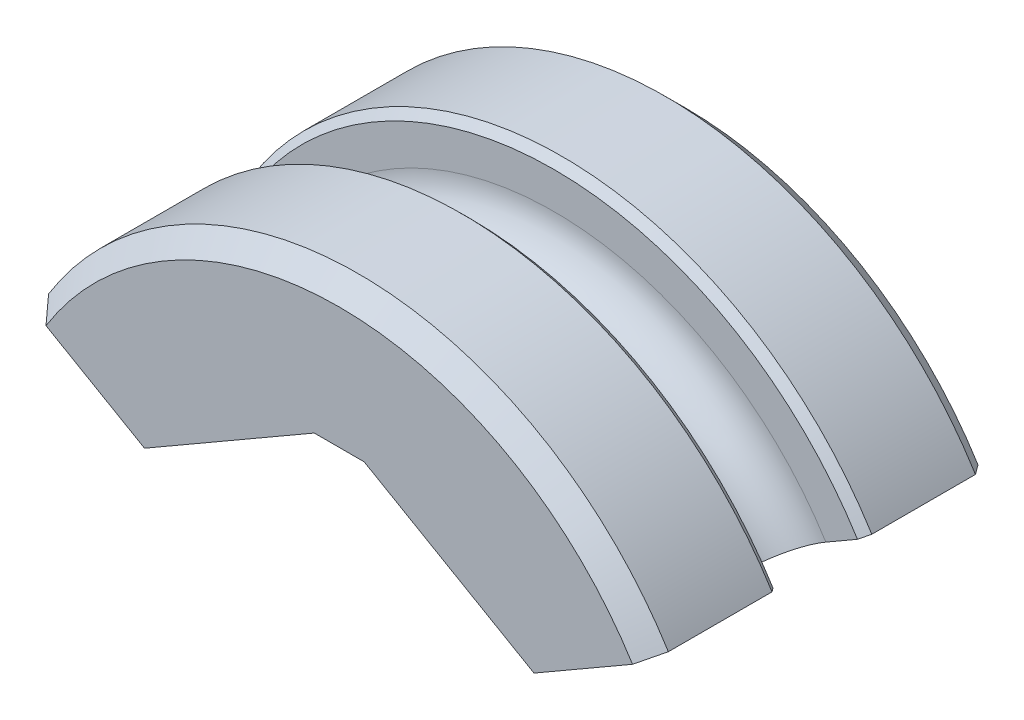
ISO-10303-21;
HEADER;
FILE_DESCRIPTION(('STEP AP214'),'2;1');
FILE_NAME('part.step','',(''),(''),'','','');
FILE_SCHEMA(('AUTOMOTIVE_DESIGN { 1 0 10303 214 1 1 1 1 }'));
ENDSEC;
DATA;
#1=APPLICATION_CONTEXT('core data for automotive mechanical design processes');
#2=APPLICATION_PROTOCOL_DEFINITION('international standard','automotive_design',2000,#1);
#3=PRODUCT_CONTEXT('',#1,'mechanical');
#4=PRODUCT('Part','Part','',(#3));
#5=PRODUCT_RELATED_PRODUCT_CATEGORY('part','',(#4));
#6=PRODUCT_DEFINITION_FORMATION('','',#4);
#7=PRODUCT_DEFINITION_CONTEXT('part definition',#1,'design');
#8=PRODUCT_DEFINITION('design','',#6,#7);
#9=PRODUCT_DEFINITION_SHAPE('','',#8);
#10=(LENGTH_UNIT() NAMED_UNIT(*) SI_UNIT(.MILLI.,.METRE.));
#11=(NAMED_UNIT(*) PLANE_ANGLE_UNIT() SI_UNIT($,.RADIAN.));
#12=(NAMED_UNIT(*) SI_UNIT($,.STERADIAN.) SOLID_ANGLE_UNIT());
#13=UNCERTAINTY_MEASURE_WITH_UNIT(LENGTH_MEASURE(1.E-05),#10,'distance_accuracy_value','');
#14=(GEOMETRIC_REPRESENTATION_CONTEXT(3) GLOBAL_UNCERTAINTY_ASSIGNED_CONTEXT((#13)) GLOBAL_UNIT_ASSIGNED_CONTEXT((#10,
#11,#12)) REPRESENTATION_CONTEXT('',''));
#15=CARTESIAN_POINT('',(0.,0.,0.));
#16=DIRECTION('',(0.,0.,1.));
#17=DIRECTION('',(1.,0.,0.));
#18=AXIS2_PLACEMENT_3D('',#15,#16,#17);
#19=CARTESIAN_POINT('',(0.,0.,16.4693044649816));
#20=DIRECTION('',(0.,0.,1.));
#21=DIRECTION('',(1.,0.,0.));
#22=AXIS2_PLACEMENT_3D('',#19,#20,#21);
#23=CYLINDRICAL_SURFACE('',#22,9.5);
#24=DIRECTION('',(0.,0.,1.));
#25=VECTOR('',#24,1.);
#26=CARTESIAN_POINT('',(-8.07313808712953,5.00743860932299,-9.99999999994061E-05));
#27=LINE('',#26,#25);
#28=CARTESIAN_POINT('',(-8.07313808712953,5.00743860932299,0.5));
#29=VERTEX_POINT('',#28);
#30=CARTESIAN_POINT('',(-8.07313808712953,5.00743860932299,3.2));
#31=VERTEX_POINT('',#30);
#32=EDGE_CURVE('E219',#29,#31,#27,.T.);
#33=ORIENTED_EDGE('',*,*,#32,.T.);
#34=CARTESIAN_POINT('',(0.,0.,3.2));
#35=DIRECTION('',(0.,0.,-1.));
#36=DIRECTION('',(-1.,0.,0.));
#37=AXIS2_PLACEMENT_3D('',#34,#35,#36);
#38=CIRCLE('',#37,9.5);
#39=CARTESIAN_POINT('',(8.07313808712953,5.00743860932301,3.2));
#40=VERTEX_POINT('',#39);
#41=EDGE_CURVE('E248',#31,#40,#38,.T.);
#42=ORIENTED_EDGE('',*,*,#41,.T.);
#43=DIRECTION('',(0.,0.,1.));
#44=VECTOR('',#43,1.);
#45=CARTESIAN_POINT('',(8.07313808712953,5.00743860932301,-9.99999999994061E-05));
#46=LINE('',#45,#44);
#47=CARTESIAN_POINT('',(8.07313808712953,5.00743860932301,0.5));
#48=VERTEX_POINT('',#47);
#49=EDGE_CURVE('E161',#48,#40,#46,.T.);
#50=ORIENTED_EDGE('',*,*,#49,.F.);
#51=CARTESIAN_POINT('',(0.,0.,0.5));
#52=DIRECTION('',(0.,0.,1.));
#53=DIRECTION('',(1.,0.,0.));
#54=AXIS2_PLACEMENT_3D('',#51,#52,#53);
#55=CIRCLE('',#54,9.5);
#56=EDGE_CURVE('E244',#48,#29,#55,.T.);
#57=ORIENTED_EDGE('',*,*,#56,.T.);
#58=EDGE_LOOP('',(#33,#42,#50,#57));
#59=FACE_BOUND('',#58,.T.);
#60=ADVANCED_FACE('F14',(#59),#23,.T.);
#61=CARTESIAN_POINT('',(0.,7.25555349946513,11.5));
#62=DIRECTION('',(0.469846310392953,0.813797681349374,-0.342020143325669));
#63=DIRECTION('',(0.866025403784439,-0.5,0.));
#64=AXIS2_PLACEMENT_3D('',#61,#62,#63);
#65=PLANE('',#64);
#66=DIRECTION('',(0.,0.387449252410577,0.921891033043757));
#67=VECTOR('',#66,1.);
#68=CARTESIAN_POINT('',(0.650000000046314,6.93661135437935,11.634043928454));
#69=LINE('',#68,#67);
#70=CARTESIAN_POINT('',(0.650000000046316,2.41402154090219,0.873060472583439));
#71=VERTEX_POINT('',#70);
#72=CARTESIAN_POINT('',(0.650000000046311,5.82958426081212,9.));
#73=VERTEX_POINT('',#72);
#74=EDGE_CURVE('E148',#71,#73,#69,.T.);
#75=ORIENTED_EDGE('',*,*,#74,.F.);
#76=CARTESIAN_POINT('',(0.,0.,-5.76375691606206));
#77=DIRECTION('',(0.469846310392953,0.813797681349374,-0.342020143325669));
#78=DIRECTION('',(-0.171010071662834,-0.296198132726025,-0.939692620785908));
#79=AXIS2_PLACEMENT_3D('',#76,#77,#78);
#80=ELLIPSE('',#79,7.30951100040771,2.5);
#81=CARTESIAN_POINT('',(1.99941852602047,1.50077498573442,0.553843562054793));
#82=VERTEX_POINT('',#81);
#83=EDGE_CURVE('E135',#71,#82,#80,.T.);
#84=ORIENTED_EDGE('',*,*,#83,.T.);
#85=DIRECTION('',(0.335540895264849,0.193724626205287,0.921891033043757));
#86=VECTOR('',#85,1.);
#87=CARTESIAN_POINT('',(5.53438182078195,3.5416869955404,10.2660753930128));
#88=LINE('',#87,#86);
#89=CARTESIAN_POINT('',(5.07356806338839,3.27563604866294,9.));
#90=VERTEX_POINT('',#89);
#91=EDGE_CURVE('E146',#82,#90,#88,.T.);
#92=ORIENTED_EDGE('',*,*,#91,.T.);
#93=DIRECTION('',(0.866025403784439,-0.5,0.));
#94=VECTOR('',#93,1.);
#95=CARTESIAN_POINT('',(2.68678403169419,4.65364645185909,9.));
#96=LINE('',#95,#94);
#97=EDGE_CURVE('E168',#73,#90,#96,.T.);
#98=ORIENTED_EDGE('',*,*,#97,.F.);
#99=EDGE_LOOP('',(#75,#84,#92,#98));
#100=FACE_BOUND('',#99,.T.);
#101=ADVANCED_FACE('F144',(#100),#65,.F.);
#102=CARTESIAN_POINT('',(-6.5,3.50277674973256,11.5));
#103=DIRECTION('',(-0.469846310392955,0.813797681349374,-0.342020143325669));
#104=DIRECTION('',(0.866025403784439,0.5,0.));
#105=AXIS2_PLACEMENT_3D('',#102,#103,#104);
#106=PLANE('',#105);
#107=DIRECTION('',(0.335540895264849,-0.193724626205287,-0.921891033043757));
#108=VECTOR('',#107,1.);
#109=CARTESIAN_POINT('',(-6.02226182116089,3.82336464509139,11.6065146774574));
#110=LINE('',#109,#108);
#111=CARTESIAN_POINT('',(-5.07356806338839,3.27563604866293,9.));
#112=VERTEX_POINT('',#111);
#113=CARTESIAN_POINT('',(-1.99941852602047,1.50077498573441,0.553843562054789));
#114=VERTEX_POINT('',#113);
#115=EDGE_CURVE('E156',#112,#114,#110,.T.);
#116=ORIENTED_EDGE('',*,*,#115,.T.);
#117=CARTESIAN_POINT('',(0.,0.,-5.76375691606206));
#118=DIRECTION('',(-0.469846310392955,0.813797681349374,-0.342020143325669));
#119=DIRECTION('',(0.171010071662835,-0.296198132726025,-0.939692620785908));
#120=AXIS2_PLACEMENT_3D('',#117,#118,#119);
#121=ELLIPSE('',#120,7.30951100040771,2.5);
#122=CARTESIAN_POINT('',(-0.650000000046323,2.41402154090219,0.873060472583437));
#123=VERTEX_POINT('',#122);
#124=EDGE_CURVE('E322',#114,#123,#121,.T.);
#125=ORIENTED_EDGE('',*,*,#124,.T.);
#126=DIRECTION('',(0.,-0.387449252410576,-0.921891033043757));
#127=VECTOR('',#126,1.);
#128=CARTESIAN_POINT('',(-0.650000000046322,6.37325605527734,10.2936046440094));
#129=LINE('',#128,#127);
#130=CARTESIAN_POINT('',(-0.65000000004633,5.82958426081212,9.));
#131=VERTEX_POINT('',#130);
#132=EDGE_CURVE('E170',#131,#123,#129,.T.);
#133=ORIENTED_EDGE('',*,*,#132,.F.);
#134=DIRECTION('',(0.866025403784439,0.5,0.));
#135=VECTOR('',#134,1.);
#136=CARTESIAN_POINT('',(-2.6867840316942,4.65364645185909,9.));
#137=LINE('',#136,#135);
#138=EDGE_CURVE('E166',#112,#131,#137,.T.);
#139=ORIENTED_EDGE('',*,*,#138,.F.);
#140=EDGE_LOOP('',(#116,#125,#133,#139));
#141=FACE_BOUND('',#140,.T.);
#142=ADVANCED_FACE('F331',(#141),#106,.F.);
#143=CARTESIAN_POINT('',(0.,0.,9.));
#144=DIRECTION('',(0.,0.,-1.));
#145=DIRECTION('',(-1.,0.,0.));
#146=AXIS2_PLACEMENT_3D('',#143,#144,#145);
#147=PLANE('',#146);
#148=DIRECTION('',(-0.866025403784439,-0.5,0.));
#149=VECTOR('',#148,1.);
#150=CARTESIAN_POINT('',(0.,0.346410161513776,9.));
#151=LINE('',#150,#149);
#152=CARTESIAN_POINT('',(7.63989730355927,4.75730692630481,9.));
#153=VERTEX_POINT('',#152);
#154=EDGE_CURVE('E153',#153,#90,#151,.T.);
#155=ORIENTED_EDGE('',*,*,#154,.F.);
#156=CARTESIAN_POINT('',(0.,0.,9.));
#157=DIRECTION('',(0.,0.,-1.));
#158=DIRECTION('',(-1.,0.,0.));
#159=AXIS2_PLACEMENT_3D('',#156,#157,#158);
#160=CIRCLE('',#159,9.);
#161=CARTESIAN_POINT('',(-7.63989730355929,4.75730692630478,9.));
#162=VERTEX_POINT('',#161);
#163=EDGE_CURVE('E249',#153,#162,#160,.F.);
#164=ORIENTED_EDGE('',*,*,#163,.T.);
#165=DIRECTION('',(-0.86602540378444,0.5,0.));
#166=VECTOR('',#165,1.);
#167=CARTESIAN_POINT('',(0.,0.346410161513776,9.));
#168=LINE('',#167,#166);
#169=EDGE_CURVE('E213',#112,#162,#168,.T.);
#170=ORIENTED_EDGE('',*,*,#169,.F.);
#171=ORIENTED_EDGE('',*,*,#138,.T.);
#172=DIRECTION('',(-1.,0.,0.));
#173=VECTOR('',#172,1.);
#174=CARTESIAN_POINT('',(1.5,5.82958426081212,9.));
#175=LINE('',#174,#173);
#176=EDGE_CURVE('E155',#73,#131,#175,.T.);
#177=ORIENTED_EDGE('',*,*,#176,.F.);
#178=ORIENTED_EDGE('',*,*,#97,.T.);
#179=EDGE_LOOP('',(#155,#164,#170,#171,#177,#178));
#180=FACE_BOUND('',#179,.T.);
#181=ADVANCED_FACE('F334',(#180),#147,.F.);
#182=CARTESIAN_POINT('',(8.07313808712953,5.00743860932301,5.8));
#183=VERTEX_POINT('',#182);
#184=CARTESIAN_POINT('',(8.07313808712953,5.00743860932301,8.5));
#185=VERTEX_POINT('',#184);
#186=EDGE_CURVE('E218',#183,#185,#46,.T.);
#187=ORIENTED_EDGE('',*,*,#186,.F.);
#188=CARTESIAN_POINT('',(0.,0.,5.8));
#189=DIRECTION('',(0.,0.,1.));
#190=DIRECTION('',(1.,0.,0.));
#191=AXIS2_PLACEMENT_3D('',#188,#189,#190);
#192=CIRCLE('',#191,9.5);
#193=CARTESIAN_POINT('',(-8.07313808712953,5.00743860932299,5.8));
#194=VERTEX_POINT('',#193);
#195=EDGE_CURVE('E140',#183,#194,#192,.T.);
#196=ORIENTED_EDGE('',*,*,#195,.T.);
#197=CARTESIAN_POINT('',(-8.07313808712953,5.00743860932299,8.5));
#198=VERTEX_POINT('',#197);
#199=EDGE_CURVE('E216',#194,#198,#27,.T.);
#200=ORIENTED_EDGE('',*,*,#199,.T.);
#201=CARTESIAN_POINT('',(0.,0.,8.5));
#202=DIRECTION('',(0.,0.,-1.));
#203=DIRECTION('',(-1.,0.,0.));
#204=AXIS2_PLACEMENT_3D('',#201,#202,#203);
#205=CIRCLE('',#204,9.5);
#206=EDGE_CURVE('E233',#198,#185,#205,.T.);
#207=ORIENTED_EDGE('',*,*,#206,.T.);
#208=EDGE_LOOP('',(#187,#196,#200,#207));
#209=FACE_BOUND('',#208,.T.);
#210=ADVANCED_FACE('F231',(#209),#23,.T.);
#211=CARTESIAN_POINT('',(0.,0.,0.));
#212=DIRECTION('',(0.,0.,1.));
#213=DIRECTION('',(1.,0.,0.));
#214=AXIS2_PLACEMENT_3D('',#211,#212,#213);
#215=PLANE('',#214);
#216=DIRECTION('',(-0.866025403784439,-0.5,0.));
#217=VECTOR('',#216,1.);
#218=CARTESIAN_POINT('',(-0.15,0.259807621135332,0.));
#219=LINE('',#218,#217);
#220=CARTESIAN_POINT('',(7.63989730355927,4.75730692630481,0.));
#221=VERTEX_POINT('',#220);
#222=CARTESIAN_POINT('',(2.17379000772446,1.60144840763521,0.));
#223=VERTEX_POINT('',#222);
#224=EDGE_CURVE('E175',#221,#223,#219,.T.);
#225=ORIENTED_EDGE('',*,*,#224,.T.);
#226=CARTESIAN_POINT('',(0.,0.,0.));
#227=DIRECTION('',(0.,0.,1.));
#228=DIRECTION('',(1.,0.,0.));
#229=AXIS2_PLACEMENT_3D('',#226,#227,#228);
#230=CIRCLE('',#229,2.7);
#231=CARTESIAN_POINT('',(-2.17379000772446,1.6014484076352,0.));
#232=VERTEX_POINT('',#231);
#233=EDGE_CURVE('E28',#223,#232,#230,.T.);
#234=ORIENTED_EDGE('',*,*,#233,.T.);
#235=DIRECTION('',(-0.86602540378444,0.5,0.));
#236=VECTOR('',#235,1.);
#237=CARTESIAN_POINT('',(0.15,0.259807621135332,0.));
#238=LINE('',#237,#236);
#239=CARTESIAN_POINT('',(-7.63989730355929,4.75730692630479,0.));
#240=VERTEX_POINT('',#239);
#241=EDGE_CURVE('E173',#232,#240,#238,.T.);
#242=ORIENTED_EDGE('',*,*,#241,.T.);
#243=CARTESIAN_POINT('',(0.,0.,0.));
#244=DIRECTION('',(0.,0.,1.));
#245=DIRECTION('',(1.,0.,0.));
#246=AXIS2_PLACEMENT_3D('',#243,#244,#245);
#247=CIRCLE('',#246,9.);
#248=EDGE_CURVE('E482',#240,#221,#247,.F.);
#249=ORIENTED_EDGE('',*,*,#248,.T.);
#250=EDGE_LOOP('',(#225,#234,#242,#249));
#251=FACE_BOUND('',#250,.T.);
#252=ADVANCED_FACE('F343',(#251),#215,.F.);
#253=CARTESIAN_POINT('',(1.5,5.82958426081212,9.));
#254=DIRECTION('',(0.,0.921891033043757,-0.387449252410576));
#255=DIRECTION('',(0.,0.387449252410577,0.921891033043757));
#256=AXIS2_PLACEMENT_3D('',#253,#254,#255);
#257=PLANE('',#256);
#258=ORIENTED_EDGE('',*,*,#132,.T.);
#259=CARTESIAN_POINT('',(0.,0.,-4.87082675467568));
#260=DIRECTION('',(0.,0.921891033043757,-0.387449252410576));
#261=DIRECTION('',(0.,-0.387449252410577,-0.921891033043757));
#262=AXIS2_PLACEMENT_3D('',#259,#260,#261);
#263=ELLIPSE('',#262,6.45245792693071,2.5);
#264=EDGE_CURVE('E149',#123,#71,#263,.T.);
#265=ORIENTED_EDGE('',*,*,#264,.T.);
#266=ORIENTED_EDGE('',*,*,#74,.T.);
#267=ORIENTED_EDGE('',*,*,#176,.T.);
#268=EDGE_LOOP('',(#258,#265,#266,#267));
#269=FACE_BOUND('',#268,.T.);
#270=ADVANCED_FACE('F326',(#269),#257,.F.);
#271=CARTESIAN_POINT('',(0.,0.346410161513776,-9.99999999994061E-05));
#272=DIRECTION('',(0.5,0.86602540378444,0.));
#273=DIRECTION('',(-0.86602540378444,0.5,0.));
#274=AXIS2_PLACEMENT_3D('',#271,#272,#273);
#275=PLANE('',#274);
#276=ORIENTED_EDGE('',*,*,#241,.F.);
#277=CARTESIAN_POINT('',(-2.17379000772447,1.6014484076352,0.));
#278=CARTESIAN_POINT('',(-2.14473559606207,1.58467383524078,0.0333420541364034));
#279=CARTESIAN_POINT('',(-2.11567743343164,1.56789709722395,0.0666797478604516));
#280=CARTESIAN_POINT('',(-2.05755360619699,1.53433928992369,0.13334641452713));
#281=CARTESIAN_POINT('',(-2.02848794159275,1.51755822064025,0.166675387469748));
#282=CARTESIAN_POINT('',(-1.99941852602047,1.50077498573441,0.2));
#283=B_SPLINE_CURVE_WITH_KNOTS('',3,(#277,#278,#279,#280,#281,#282),.UNSPECIFIED.,.F.,.F.,(4,2,
4),(0.,0.141898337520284,0.28379667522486),.UNSPECIFIED.);
#284=CARTESIAN_POINT('',(-1.99941852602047,1.50077498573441,0.2));
#285=VERTEX_POINT('',#284);
#286=EDGE_CURVE('E9',#232,#285,#283,.T.);
#287=ORIENTED_EDGE('',*,*,#286,.T.);
#288=DIRECTION('',(0.,0.,-1.));
#289=VECTOR('',#288,1.);
#290=CARTESIAN_POINT('',(-1.99941852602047,1.50077498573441,9.));
#291=LINE('',#290,#289);
#292=EDGE_CURVE('E318',#285,#114,#291,.F.);
#293=ORIENTED_EDGE('',*,*,#292,.T.);
#294=ORIENTED_EDGE('',*,*,#115,.F.);
#295=ORIENTED_EDGE('',*,*,#169,.T.);
#296=CARTESIAN_POINT('',(-7.63989730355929,4.75730692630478,9.));
#297=CARTESIAN_POINT('',(-7.71210512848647,4.79899613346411,8.91666785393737));
#298=CARTESIAN_POINT('',(-7.78431243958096,4.84068504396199,8.83333511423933));
#299=CARTESIAN_POINT('',(-7.92872603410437,4.92406227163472,8.66666844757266));
#300=CARTESIAN_POINT('',(-8.00093231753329,4.96575058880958,8.58333452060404));
#301=CARTESIAN_POINT('',(-8.07313808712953,5.00743860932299,8.5));
#302=B_SPLINE_CURVE_WITH_KNOTS('',3,(#296,#297,#298,#299,#300,#301),.UNSPECIFIED.,.F.,.F.,(4,2,
4),(0.,0.353646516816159,0.707293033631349),.UNSPECIFIED.);
#303=EDGE_CURVE('E238',#162,#198,#302,.T.);
#304=ORIENTED_EDGE('',*,*,#303,.T.);
#305=ORIENTED_EDGE('',*,*,#199,.F.);
#306=CARTESIAN_POINT('',(-8.07313808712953,5.00743860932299,5.8));
#307=CARTESIAN_POINT('',(-8.04425601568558,4.9907635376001,5.76666648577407));
#308=CARTESIAN_POINT('',(-8.01537386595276,4.97408842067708,5.73333306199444));
#309=CARTESIAN_POINT('',(-7.95760940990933,4.94073809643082,5.66666639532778));
#310=CARTESIAN_POINT('',(-7.92872710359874,4.92406288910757,5.63333315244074));
#311=CARTESIAN_POINT('',(-7.89984471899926,4.9073876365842,5.6));
#312=B_SPLINE_CURVE_WITH_KNOTS('',3,(#306,#307,#308,#309,#310,#311),.UNSPECIFIED.,.F.,.F.,(4,2,
4),(0.,0.141457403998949,0.28291480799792),.UNSPECIFIED.);
#313=CARTESIAN_POINT('',(-7.89984471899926,4.9073876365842,5.6));
#314=VERTEX_POINT('',#313);
#315=EDGE_CURVE('E278',#194,#314,#312,.T.);
#316=ORIENTED_EDGE('',*,*,#315,.T.);
#317=DIRECTION('',(0.86602540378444,-0.5,0.));
#318=VECTOR('',#317,1.);
#319=CARTESIAN_POINT('',(0.,0.346410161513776,5.6));
#320=LINE('',#319,#318);
#321=CARTESIAN_POINT('',(-7.07664341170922,4.43211214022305,5.6));
#322=VERTEX_POINT('',#321);
#323=EDGE_CURVE('E306',#314,#322,#320,.T.);
#324=ORIENTED_EDGE('',*,*,#323,.T.);
#325=CARTESIAN_POINT('',(-6.40427982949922,4.0439228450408,3.72019614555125));
#326=CARTESIAN_POINT('',(-6.44226630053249,4.06585434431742,3.67659501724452));
#327=CARTESIAN_POINT('',(-6.48347090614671,4.08964383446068,3.63666795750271));
#328=CARTESIAN_POINT('',(-6.5711361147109,4.14025736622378,3.5653372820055));
#329=CARTESIAN_POINT('',(-6.6176030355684,4.16708505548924,3.53394406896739));
#330=CARTESIAN_POINT('',(-6.71442280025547,4.22298397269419,3.48062452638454));
#331=CARTESIAN_POINT('',(-6.76477369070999,4.25205407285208,3.45869347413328));
#332=CARTESIAN_POINT('',(-6.86793499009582,4.31161427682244,3.42490666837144));
#333=CARTESIAN_POINT('',(-6.92074478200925,4.34210402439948,3.41304840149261));
#334=CARTESIAN_POINT('',(-7.02736153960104,4.40365923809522,3.39972928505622));
#335=CARTESIAN_POINT('',(-7.08116891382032,4.43472494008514,3.3982727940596));
#336=CARTESIAN_POINT('',(-7.18823385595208,4.49653891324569,3.40581149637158));
#337=CARTESIAN_POINT('',(-7.24149140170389,4.52728717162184,3.41480710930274));
#338=CARTESIAN_POINT('',(-7.34594081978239,4.58759107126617,3.4429965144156));
#339=CARTESIAN_POINT('',(-7.3971327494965,4.61714674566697,3.46219002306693));
#340=CARTESIAN_POINT('',(-7.49599769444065,4.67422644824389,3.51023223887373));
#341=CARTESIAN_POINT('',(-7.54367072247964,4.70175048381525,3.53908091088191));
#342=CARTESIAN_POINT('',(-7.63412506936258,4.75397432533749,3.60560359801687));
#343=CARTESIAN_POINT('',(-7.67690822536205,4.7786751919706,3.64327428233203));
#344=CARTESIAN_POINT('',(-7.75638638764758,4.82456193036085,3.72637887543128));
#345=CARTESIAN_POINT('',(-7.79308142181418,4.84574781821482,3.77181274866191));
#346=CARTESIAN_POINT('',(-7.85932064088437,4.88399104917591,3.86912770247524));
#347=CARTESIAN_POINT('',(-7.888868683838,4.90105061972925,3.9210052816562));
#348=CARTESIAN_POINT('',(-7.93999841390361,4.93057038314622,4.02975450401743));
#349=CARTESIAN_POINT('',(-7.96158011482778,4.94303058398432,4.08662613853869));
#350=CARTESIAN_POINT('',(-7.99615381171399,4.96299171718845,4.20371885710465));
#351=CARTESIAN_POINT('',(-8.00915003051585,4.9704950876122,4.26393827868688));
#352=CARTESIAN_POINT('',(-8.02619969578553,4.98033871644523,4.38604200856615));
#353=CARTESIAN_POINT('',(-8.03025316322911,4.98267898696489,4.44792631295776));
#354=CARTESIAN_POINT('',(-8.02930206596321,4.9821298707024,4.57158420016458));
#355=CARTESIAN_POINT('',(-8.02430010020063,4.97924198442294,4.63335780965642));
#356=CARTESIAN_POINT('',(-8.00538560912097,4.96832169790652,4.75505849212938));
#357=CARTESIAN_POINT('',(-7.99147308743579,4.96028929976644,4.81498556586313));
#358=CARTESIAN_POINT('',(-7.95513346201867,4.93930860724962,4.93129226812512));
#359=CARTESIAN_POINT('',(-7.9327063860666,4.92636032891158,4.98767190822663));
#360=CARTESIAN_POINT('',(-7.87997554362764,4.89591616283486,5.09528494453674));
#361=CARTESIAN_POINT('',(-7.84967176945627,4.87842027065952,5.1465183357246));
#362=CARTESIAN_POINT('',(-7.78203927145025,4.83937262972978,5.24240053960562));
#363=CARTESIAN_POINT('',(-7.74470857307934,4.81781974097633,5.28704749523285));
#364=CARTESIAN_POINT('',(-7.6640884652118,4.77127369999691,5.36847514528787));
#365=CARTESIAN_POINT('',(-7.62079904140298,4.74628053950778,5.40525582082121));
#366=CARTESIAN_POINT('',(-7.52946788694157,4.6935504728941,5.46992631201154));
#367=CARTESIAN_POINT('',(-7.48142384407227,4.66581223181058,5.4978117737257));
#368=CARTESIAN_POINT('',(-7.38196487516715,4.60838956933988,5.54387894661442));
#369=CARTESIAN_POINT('',(-7.33054993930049,4.57870514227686,5.56206062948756));
#370=CARTESIAN_POINT('',(-7.2257788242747,4.51821551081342,5.58821414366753));
#371=CARTESIAN_POINT('',(-7.17242160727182,4.48740970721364,5.59618043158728));
#372=CARTESIAN_POINT('',(-7.06530605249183,4.42556651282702,5.60166059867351));
#373=CARTESIAN_POINT('',(-7.0115477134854,4.39452912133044,5.59917444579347));
#374=CARTESIAN_POINT('',(-6.90513401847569,4.33309114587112,5.58381784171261));
#375=CARTESIAN_POINT('',(-6.85247909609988,4.30269081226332,5.57094338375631));
#376=CARTESIAN_POINT('',(-6.74978832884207,4.24340227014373,5.53516995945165));
#377=CARTESIAN_POINT('',(-6.69975248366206,4.21451406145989,5.51227099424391));
#378=CARTESIAN_POINT('',(-6.60371996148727,4.15906965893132,5.45709638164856));
#379=CARTESIAN_POINT('',(-6.55772336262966,4.1325135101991,5.42482055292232));
#380=CARTESIAN_POINT('',(-6.47107824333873,4.08248892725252,5.3518064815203));
#381=CARTESIAN_POINT('',(-6.4304297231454,4.05902049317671,5.31106823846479));
#382=CARTESIAN_POINT('',(-6.35565491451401,4.01584923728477,5.22230398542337));
#383=CARTESIAN_POINT('',(-6.32152575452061,3.9961447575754,5.17428120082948));
#384=CARTESIAN_POINT('',(-6.26074023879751,3.96105022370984,5.07229673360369));
#385=CARTESIAN_POINT('',(-6.23408386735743,3.94566016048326,5.01833506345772));
#386=CARTESIAN_POINT('',(-6.18902179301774,3.91964355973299,4.9060472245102));
#387=CARTESIAN_POINT('',(-6.17061002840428,3.90901352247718,4.84772429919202));
#388=CARTESIAN_POINT('',(-6.14253497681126,3.89280438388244,4.72833785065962));
#389=CARTESIAN_POINT('',(-6.13287130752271,3.88722506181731,4.66727444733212));
#390=CARTESIAN_POINT('',(-6.12257118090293,3.8812782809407,4.54419000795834));
#391=CARTESIAN_POINT('',(-6.12192759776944,3.88090670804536,4.48216976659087));
#392=CARTESIAN_POINT('',(-6.12966978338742,3.88537666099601,4.35886842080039));
#393=CARTESIAN_POINT('',(-6.13805778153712,3.89021947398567,4.29758750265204));
#394=CARTESIAN_POINT('',(-6.16362614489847,3.90498137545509,4.17751060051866));
#395=CARTESIAN_POINT('',(-6.180808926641,3.9149018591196,4.11871530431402));
#396=CARTESIAN_POINT('',(-6.22346838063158,3.93953130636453,4.00534160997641));
#397=CARTESIAN_POINT('',(-6.24893505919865,3.95423450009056,3.9507582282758));
#398=CARTESIAN_POINT('',(-6.29639416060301,3.98163502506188,3.86679941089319));
#399=CARTESIAN_POINT('',(-6.31609280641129,3.99300804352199,3.83566228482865));
#400=CARTESIAN_POINT('',(-6.35820468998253,4.01732135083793,3.77594029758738));
#401=CARTESIAN_POINT('',(-6.38061792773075,4.03026163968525,3.74735543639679));
#402=CARTESIAN_POINT('',(-6.40427982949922,4.0439228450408,3.72019614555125));
#403=B_SPLINE_CURVE_WITH_KNOTS('',3,(#325,#326,#327,#328,#329,#330,#331,#332,#333,#334,#335,
#336,#337,#338,#339,#340,#341,#342,#343,#344,#345,#346,#347,#348,#349,#350,#351,#352,#353,#354,
#355,#356,#357,#358,#359,#360,#361,#362,#363,#364,#365,#366,#367,#368,#369,#370,#371,#372,#373,
#374,#375,#376,#377,#378,#379,#380,#381,#382,#383,#384,#385,#386,#387,#388,#389,#390,#391,#392,
#393,#394,#395,#396,#397,#398,#399,#400,#401,#402),.UNSPECIFIED.,.T.,.F.,(4,2,2,2,2,2,2,2,2,2,2,
2,2,2,2,2,2,2,2,2,2,2,2,2,2,2,2,2,2,2,2,2,2,2,2,2,2,2,4),(0.,0.185399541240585,
0.371024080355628,0.556555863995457,0.742041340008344,0.927604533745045,1.11317517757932,
1.29874066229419,1.48430547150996,1.66980033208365,1.85529434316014,2.04068799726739,
2.22608132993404,2.41138340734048,2.59668505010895,2.78193351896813,2.96718191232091,
3.15242970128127,3.33767767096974,3.52297777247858,3.7082783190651,3.89366942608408,
4.07906107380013,4.26455328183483,4.45004605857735,4.63561041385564,4.82117474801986,
5.00674267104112,5.19231060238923,5.37779660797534,5.56328222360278,5.74863123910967,
5.93397215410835,6.11916664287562,6.30440685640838,6.48969799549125,6.67476642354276,
6.79025242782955,6.90573843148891),.UNSPECIFIED.);
#404=CARTESIAN_POINT('',(-7.07664341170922,4.43211214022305,3.4));
#405=VERTEX_POINT('',#404);
#406=EDGE_CURVE('E203',#322,#405,#403,.T.);
#407=ORIENTED_EDGE('',*,*,#406,.T.);
#408=DIRECTION('',(-0.86602540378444,0.5,0.));
#409=VECTOR('',#408,1.);
#410=CARTESIAN_POINT('',(0.,0.346410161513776,3.4));
#411=LINE('',#410,#409);
#412=CARTESIAN_POINT('',(-7.89984471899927,4.9073876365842,3.4));
#413=VERTEX_POINT('',#412);
#414=EDGE_CURVE('E210',#405,#413,#411,.T.);
#415=ORIENTED_EDGE('',*,*,#414,.T.);
#416=CARTESIAN_POINT('',(-7.89984471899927,4.9073876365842,3.4));
#417=CARTESIAN_POINT('',(-7.92872710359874,4.92406288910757,3.36666684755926));
#418=CARTESIAN_POINT('',(-7.95760940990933,4.94073809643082,3.33333360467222));
#419=CARTESIAN_POINT('',(-8.01537386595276,4.97408842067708,3.26666693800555));
#420=CARTESIAN_POINT('',(-8.04425601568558,4.9907635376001,3.23333351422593));
#421=CARTESIAN_POINT('',(-8.07313808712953,5.00743860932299,3.2));
#422=B_SPLINE_CURVE_WITH_KNOTS('',3,(#416,#417,#418,#419,#420,#421),.UNSPECIFIED.,.F.,.F.,(4,2,
4),(0.,0.141457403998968,0.282914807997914),.UNSPECIFIED.);
#423=EDGE_CURVE('E284',#413,#31,#422,.T.);
#424=ORIENTED_EDGE('',*,*,#423,.T.);
#425=ORIENTED_EDGE('',*,*,#32,.F.);
#426=CARTESIAN_POINT('',(-8.07313808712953,5.00743860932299,0.5));
#427=CARTESIAN_POINT('',(-8.0009323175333,4.96575058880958,0.416665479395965));
#428=CARTESIAN_POINT('',(-7.92872603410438,4.92406227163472,0.333331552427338));
#429=CARTESIAN_POINT('',(-7.78431243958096,4.84068504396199,0.166664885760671));
#430=CARTESIAN_POINT('',(-7.71210512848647,4.79899613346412,0.0833321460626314));
#431=CARTESIAN_POINT('',(-7.63989730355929,4.75730692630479,0.));
#432=B_SPLINE_CURVE_WITH_KNOTS('',3,(#426,#427,#428,#429,#430,#431),.UNSPECIFIED.,.F.,.F.,(4,2,
4),(0.,0.353646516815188,0.707293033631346),.UNSPECIFIED.);
#433=EDGE_CURVE('E243',#29,#240,#432,.T.);
#434=ORIENTED_EDGE('',*,*,#433,.T.);
#435=EDGE_LOOP('',(#276,#287,#293,#294,#295,#304,#305,#316,#324,#407,#415,#424,#425,#434));
#436=FACE_BOUND('',#435,.T.);
#437=ADVANCED_FACE('F199',(#436),#275,.F.);
#438=CARTESIAN_POINT('',(0.,0.346410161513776,-9.99999999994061E-05));
#439=DIRECTION('',(-0.5,0.866025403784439,0.));
#440=DIRECTION('',(-0.866025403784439,-0.5,0.));
#441=AXIS2_PLACEMENT_3D('',#438,#439,#440);
#442=PLANE('',#441);
#443=DIRECTION('',(0.,0.,-1.));
#444=VECTOR('',#443,1.);
#445=CARTESIAN_POINT('',(1.99941852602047,1.50077498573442,9.));
#446=LINE('',#445,#444);
#447=CARTESIAN_POINT('',(1.99941852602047,1.50077498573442,0.2));
#448=VERTEX_POINT('',#447);
#449=EDGE_CURVE('E131',#82,#448,#446,.T.);
#450=ORIENTED_EDGE('',*,*,#449,.T.);
#451=CARTESIAN_POINT('',(1.99941852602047,1.50077498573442,0.2));
#452=CARTESIAN_POINT('',(2.02848794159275,1.51755822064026,0.166675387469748));
#453=CARTESIAN_POINT('',(2.05755360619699,1.53433928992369,0.133346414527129));
#454=CARTESIAN_POINT('',(2.11567743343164,1.56789709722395,0.0666797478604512));
#455=CARTESIAN_POINT('',(2.14473559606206,1.58467383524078,0.0333420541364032));
#456=CARTESIAN_POINT('',(2.17379000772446,1.60144840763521,0.));
#457=B_SPLINE_CURVE_WITH_KNOTS('',3,(#451,#452,#453,#454,#455,#456),.UNSPECIFIED.,.F.,.F.,(4,2,
4),(0.,0.141898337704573,0.283796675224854),.UNSPECIFIED.);
#458=EDGE_CURVE('E42',#448,#223,#457,.T.);
#459=ORIENTED_EDGE('',*,*,#458,.T.);
#460=ORIENTED_EDGE('',*,*,#224,.F.);
#461=CARTESIAN_POINT('',(7.63989730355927,4.75730692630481,0.));
#462=CARTESIAN_POINT('',(7.71210512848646,4.79899613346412,0.0833321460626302));
#463=CARTESIAN_POINT('',(7.78431243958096,4.84068504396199,0.166664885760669));
#464=CARTESIAN_POINT('',(7.92872603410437,4.92406227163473,0.333331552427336));
#465=CARTESIAN_POINT('',(8.00093231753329,4.96575058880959,0.416665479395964));
#466=CARTESIAN_POINT('',(8.07313808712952,5.00743860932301,0.5));
#467=B_SPLINE_CURVE_WITH_KNOTS('',3,(#461,#462,#463,#464,#465,#466),.UNSPECIFIED.,.F.,.F.,(4,2,
4),(0.,0.353646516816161,0.707293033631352),.UNSPECIFIED.);
#468=EDGE_CURVE('E253',#221,#48,#467,.T.);
#469=ORIENTED_EDGE('',*,*,#468,.T.);
#470=ORIENTED_EDGE('',*,*,#49,.T.);
#471=CARTESIAN_POINT('',(8.07313808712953,5.00743860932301,3.2));
#472=CARTESIAN_POINT('',(8.04425601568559,4.9907635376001,3.23333351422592));
#473=CARTESIAN_POINT('',(8.01537386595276,4.97408842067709,3.26666693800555));
#474=CARTESIAN_POINT('',(7.95760940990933,4.94073809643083,3.33333360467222));
#475=CARTESIAN_POINT('',(7.92872710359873,4.92406288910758,3.36666684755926));
#476=CARTESIAN_POINT('',(7.89984471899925,4.90738763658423,3.4));
#477=B_SPLINE_CURVE_WITH_KNOTS('',3,(#471,#472,#473,#474,#475,#476),.UNSPECIFIED.,.F.,.F.,(4,2,
4),(0.,0.14145740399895,0.282914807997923),.UNSPECIFIED.);
#478=CARTESIAN_POINT('',(7.89984471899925,4.90738763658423,3.4));
#479=VERTEX_POINT('',#478);
#480=EDGE_CURVE('E262',#40,#479,#477,.T.);
#481=ORIENTED_EDGE('',*,*,#480,.T.);
#482=DIRECTION('',(-0.866025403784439,-0.5,0.));
#483=VECTOR('',#482,1.);
#484=CARTESIAN_POINT('',(0.,0.346410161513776,3.4));
#485=LINE('',#484,#483);
#486=CARTESIAN_POINT('',(7.07664341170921,4.43211214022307,3.4));
#487=VERTEX_POINT('',#486);
#488=EDGE_CURVE('E188',#479,#487,#485,.T.);
#489=ORIENTED_EDGE('',*,*,#488,.T.);
#490=CARTESIAN_POINT('',(6.20692615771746,3.92998064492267,4.04951629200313));
#491=CARTESIAN_POINT('',(6.18501497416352,3.91733021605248,4.10583774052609));
#492=CARTESIAN_POINT('',(6.16720559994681,3.90704797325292,4.16433601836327));
#493=CARTESIAN_POINT('',(6.14033110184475,3.89153197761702,4.28400355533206));
#494=CARTESIAN_POINT('',(6.13127646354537,3.88630427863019,4.34517592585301));
#495=CARTESIAN_POINT('',(6.12219634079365,3.88106186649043,4.46838488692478));
#496=CARTESIAN_POINT('',(6.12216666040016,3.8810447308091,4.53042106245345));
#497=CARTESIAN_POINT('',(6.13112914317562,3.88621922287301,4.65360133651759));
#498=CARTESIAN_POINT('',(6.14011907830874,3.89140956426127,4.71474565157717));
#499=CARTESIAN_POINT('',(6.16685974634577,3.90684829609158,4.83442398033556));
#500=CARTESIAN_POINT('',(6.18461040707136,3.91709664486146,4.89295801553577));
#501=CARTESIAN_POINT('',(6.22836742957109,3.94235977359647,5.00575848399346));
#502=CARTESIAN_POINT('',(6.25437412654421,3.95737474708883,5.06002474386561));
#503=CARTESIAN_POINT('',(6.31391476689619,3.99175055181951,5.16277163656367));
#504=CARTESIAN_POINT('',(6.34745178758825,4.01111315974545,5.21124989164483));
#505=CARTESIAN_POINT('',(6.42109323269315,4.05363006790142,5.30102310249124));
#506=CARTESIAN_POINT('',(6.46119767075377,4.07678437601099,5.34231804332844));
#507=CARTESIAN_POINT('',(6.54686855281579,4.12624648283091,5.41658624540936));
#508=CARTESIAN_POINT('',(6.59243916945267,4.15255669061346,5.44955308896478));
#509=CARTESIAN_POINT('',(6.6877242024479,4.20756953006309,5.5061915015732));
#510=CARTESIAN_POINT('',(6.73743862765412,4.23627216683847,5.52986305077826));
#511=CARTESIAN_POINT('',(6.83963592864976,4.29527580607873,5.56725426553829));
#512=CARTESIAN_POINT('',(6.89212062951,4.32557786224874,5.5809672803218));
#513=CARTESIAN_POINT('',(6.99833883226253,4.38690297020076,5.59802716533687));
#514=CARTESIAN_POINT('',(7.05207233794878,4.41792602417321,5.60137400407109));
#515=CARTESIAN_POINT('',(7.15927778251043,4.47982111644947,5.59760545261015));
#516=CARTESIAN_POINT('',(7.21274964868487,4.51069311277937,5.59048730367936));
#517=CARTESIAN_POINT('',(7.31789907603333,4.57140116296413,5.56598424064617));
#518=CARTESIAN_POINT('',(7.36957663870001,4.60123721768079,5.54859933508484));
#519=CARTESIAN_POINT('',(7.46966004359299,4.65902039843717,5.5040583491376));
#520=CARTESIAN_POINT('',(7.51806647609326,4.68696786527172,5.47690403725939));
#521=CARTESIAN_POINT('',(7.61024166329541,4.74018523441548,5.4135925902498));
#522=CARTESIAN_POINT('',(7.65401042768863,4.76545514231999,5.37743547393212));
#523=CARTESIAN_POINT('',(7.73564544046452,4.81258713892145,5.29716276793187));
#524=CARTESIAN_POINT('',(7.77351447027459,4.83445083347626,5.25305094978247));
#525=CARTESIAN_POINT('',(7.84229720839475,4.87416256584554,5.15810870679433));
#526=CARTESIAN_POINT('',(7.87321093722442,4.89201061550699,5.1072783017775));
#527=CARTESIAN_POINT('',(7.92718788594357,4.92317422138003,5.0003715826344));
#528=CARTESIAN_POINT('',(7.95025537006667,4.93649223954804,4.94429813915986));
#529=CARTESIAN_POINT('',(7.98790628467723,4.95823000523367,4.82847403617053));
#530=CARTESIAN_POINT('',(8.00248973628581,4.96664976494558,4.76872338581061));
#531=CARTESIAN_POINT('',(8.02275289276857,4.97834870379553,4.6472681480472));
#532=CARTESIAN_POINT('',(8.02843635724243,4.98163005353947,4.58556439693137));
#533=CARTESIAN_POINT('',(8.0307495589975,4.98296558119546,4.46193108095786));
#534=CARTESIAN_POINT('',(8.02737931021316,4.98101976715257,4.40000151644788));
#535=CARTESIAN_POINT('',(8.01168246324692,4.97195718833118,4.27768598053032));
#536=CARTESIAN_POINT('',(7.99935744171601,4.96484133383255,4.21729973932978));
#537=CARTESIAN_POINT('',(7.96610357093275,4.94564220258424,4.09977321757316));
#538=CARTESIAN_POINT('',(7.94517471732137,4.93355892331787,4.04263293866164));
#539=CARTESIAN_POINT('',(7.89530552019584,4.90476692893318,3.9332126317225));
#540=CARTESIAN_POINT('',(7.86636423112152,4.88805766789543,3.8809331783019));
#541=CARTESIAN_POINT('',(7.80129408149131,4.85048939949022,3.782724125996));
#542=CARTESIAN_POINT('',(7.7651652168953,4.82963038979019,3.73679453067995));
#543=CARTESIAN_POINT('',(7.68673124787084,4.7843465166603,3.65256974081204));
#544=CARTESIAN_POINT('',(7.64442380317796,4.75992030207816,3.6142774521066));
#545=CARTESIAN_POINT('',(7.55484435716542,4.70820158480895,3.5464327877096));
#546=CARTESIAN_POINT('',(7.50757233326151,4.68090906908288,3.51688045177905));
#547=CARTESIAN_POINT('',(7.40937887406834,4.62421704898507,3.46733789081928));
#548=CARTESIAN_POINT('',(7.35845551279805,4.59481643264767,3.44735275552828));
#549=CARTESIAN_POINT('',(7.25442654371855,4.53475527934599,3.41753241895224));
#550=CARTESIAN_POINT('',(7.20132092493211,4.504094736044,3.4076972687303));
#551=CARTESIAN_POINT('',(7.09440535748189,4.44236700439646,3.39845164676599));
#552=CARTESIAN_POINT('',(7.04059505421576,4.41129961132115,3.3990466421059));
#553=CARTESIAN_POINT('',(6.93382627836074,4.34965662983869,3.41065689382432));
#554=CARTESIAN_POINT('',(6.88086777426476,4.31908102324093,3.42167176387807));
#555=CARTESIAN_POINT('',(6.77729528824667,4.25928342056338,3.45381099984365));
#556=CARTESIAN_POINT('',(6.72668166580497,4.23006163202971,3.47493691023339));
#557=CARTESIAN_POINT('',(6.62923162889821,4.17379882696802,3.52670909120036));
#558=CARTESIAN_POINT('',(6.58239615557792,4.14675835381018,3.5573577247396));
#559=CARTESIAN_POINT('',(6.49383803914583,4.09562930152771,3.62730926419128));
#560=CARTESIAN_POINT('',(6.45211698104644,4.07154163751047,3.6666148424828));
#561=CARTESIAN_POINT('',(6.37502685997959,4.02703363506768,3.75273384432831));
#562=CARTESIAN_POINT('',(6.33965019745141,4.00660890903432,3.79953815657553));
#563=CARTESIAN_POINT('',(6.28811871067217,3.97685719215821,3.88058707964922));
#564=CARTESIAN_POINT('',(6.26972731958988,3.96623891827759,3.91296966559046));
#565=CARTESIAN_POINT('',(6.23599584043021,3.94676403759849,3.97978870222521));
#566=CARTESIAN_POINT('',(6.22065575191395,3.93790743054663,4.01422515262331));
#567=CARTESIAN_POINT('',(6.20692615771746,3.92998064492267,4.04951629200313));
#568=B_SPLINE_CURVE_WITH_KNOTS('',3,(#490,#491,#492,#493,#494,#495,#496,#497,#498,#499,#500,
#501,#502,#503,#504,#505,#506,#507,#508,#509,#510,#511,#512,#513,#514,#515,#516,#517,#518,#519,
#520,#521,#522,#523,#524,#525,#526,#527,#528,#529,#530,#531,#532,#533,#534,#535,#536,#537,#538,
#539,#540,#541,#542,#543,#544,#545,#546,#547,#548,#549,#550,#551,#552,#553,#554,#555,#556,#557,
#558,#559,#560,#561,#562,#563,#564,#565,#566,#567),.UNSPECIFIED.,.T.,.F.,(4,2,2,2,2,2,2,2,2,2,2,
2,2,2,2,2,2,2,2,2,2,2,2,2,2,2,2,2,2,2,2,2,2,2,2,2,2,2,4),(0.,0.18508884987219,0.370399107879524,
0.555623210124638,0.740801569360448,0.925978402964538,1.1111627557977,1.29642292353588,
1.48168347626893,1.66708635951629,1.85248963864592,2.0380166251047,2.22354417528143,
2.40912064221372,2.5946969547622,2.78023969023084,2.96578203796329,3.15123664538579,
3.33669070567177,3.52204381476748,3.70739646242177,3.89267079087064,4.07794483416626,
4.26318626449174,4.44842778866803,4.63369118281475,4.81895468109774,5.00428853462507,
5.18962323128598,5.37505641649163,5.56049053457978,5.74602185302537,5.93154629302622,
6.11709908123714,6.30269794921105,6.48835419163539,6.67378654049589,6.78976362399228,
6.90574069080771),.UNSPECIFIED.);
#569=CARTESIAN_POINT('',(7.07664341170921,4.43211214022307,5.6));
#570=VERTEX_POINT('',#569);
#571=EDGE_CURVE('E180',#487,#570,#568,.T.);
#572=ORIENTED_EDGE('',*,*,#571,.T.);
#573=DIRECTION('',(0.866025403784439,0.5,0.));
#574=VECTOR('',#573,1.);
#575=CARTESIAN_POINT('',(0.,0.346410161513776,5.6));
#576=LINE('',#575,#574);
#577=CARTESIAN_POINT('',(7.89984471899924,4.90738763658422,5.6));
#578=VERTEX_POINT('',#577);
#579=EDGE_CURVE('E177',#570,#578,#576,.T.);
#580=ORIENTED_EDGE('',*,*,#579,.T.);
#581=CARTESIAN_POINT('',(7.89984471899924,4.90738763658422,5.6));
#582=CARTESIAN_POINT('',(7.92872710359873,4.92406288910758,5.63333315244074));
#583=CARTESIAN_POINT('',(7.95760940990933,4.94073809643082,5.66666639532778));
#584=CARTESIAN_POINT('',(8.01537386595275,4.97408842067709,5.73333306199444));
#585=CARTESIAN_POINT('',(8.04425601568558,4.9907635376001,5.76666648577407));
#586=CARTESIAN_POINT('',(8.07313808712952,5.00743860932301,5.8));
#587=B_SPLINE_CURVE_WITH_KNOTS('',3,(#581,#582,#583,#584,#585,#586),.UNSPECIFIED.,.F.,.F.,(4,2,
4),(0.,0.141457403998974,0.282914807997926),.UNSPECIFIED.);
#588=EDGE_CURVE('E251',#578,#183,#587,.T.);
#589=ORIENTED_EDGE('',*,*,#588,.T.);
#590=ORIENTED_EDGE('',*,*,#186,.T.);
#591=CARTESIAN_POINT('',(8.07313808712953,5.00743860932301,8.5));
#592=CARTESIAN_POINT('',(8.0009323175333,4.96575058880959,8.58333452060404));
#593=CARTESIAN_POINT('',(7.92872603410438,4.92406227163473,8.66666844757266));
#594=CARTESIAN_POINT('',(7.78431243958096,4.84068504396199,8.83333511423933));
#595=CARTESIAN_POINT('',(7.71210512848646,4.79899613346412,8.91666785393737));
#596=CARTESIAN_POINT('',(7.63989730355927,4.75730692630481,9.));
#597=B_SPLINE_CURVE_WITH_KNOTS('',3,(#591,#592,#593,#594,#595,#596),.UNSPECIFIED.,.F.,.F.,(4,2,
4),(0.,0.353646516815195,0.707293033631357),.UNSPECIFIED.);
#598=EDGE_CURVE('E247',#185,#153,#597,.T.);
#599=ORIENTED_EDGE('',*,*,#598,.T.);
#600=ORIENTED_EDGE('',*,*,#154,.T.);
#601=ORIENTED_EDGE('',*,*,#91,.F.);
#602=EDGE_LOOP('',(#450,#459,#460,#469,#470,#481,#489,#572,#580,#589,#590,#599,#600,#601));
#603=FACE_BOUND('',#602,.T.);
#604=ADVANCED_FACE('F151',(#603),#442,.F.);
#605=CARTESIAN_POINT('',(0.,0.,4.5));
#606=DIRECTION('',(0.,0.,-1.));
#607=DIRECTION('',(-1.,0.,0.));
#608=AXIS2_PLACEMENT_3D('',#605,#606,#607);
#609=TOROIDAL_SURFACE('',#608,8.35,1.1);
#610=CARTESIAN_POINT('',(0.,0.,5.6));
#611=DIRECTION('',(0.,0.,-1.));
#612=DIRECTION('',(-1.,0.,0.));
#613=AXIS2_PLACEMENT_3D('',#610,#611,#612);
#614=CIRCLE('',#613,8.35);
#615=EDGE_CURVE('E313',#322,#570,#614,.T.);
#616=ORIENTED_EDGE('',*,*,#615,.T.);
#617=ORIENTED_EDGE('',*,*,#571,.F.);
#618=CARTESIAN_POINT('',(0.,0.,3.4));
#619=DIRECTION('',(0.,0.,-1.));
#620=DIRECTION('',(-1.,0.,0.));
#621=AXIS2_PLACEMENT_3D('',#618,#619,#620);
#622=CIRCLE('',#621,8.35);
#623=EDGE_CURVE('E312',#405,#487,#622,.T.);
#624=ORIENTED_EDGE('',*,*,#623,.F.);
#625=ORIENTED_EDGE('',*,*,#406,.F.);
#626=EDGE_LOOP('',(#616,#617,#624,#625));
#627=FACE_BOUND('',#626,.T.);
#628=ADVANCED_FACE('F192',(#627),#609,.F.);
#629=CARTESIAN_POINT('',(0.,8.35,3.4));
#630=DIRECTION('',(0.,0.,-1.));
#631=DIRECTION('',(-1.,0.,0.));
#632=AXIS2_PLACEMENT_3D('',#629,#630,#631);
#633=PLANE('',#632);
#634=ORIENTED_EDGE('',*,*,#488,.F.);
#635=CARTESIAN_POINT('',(0.,0.,3.4));
#636=DIRECTION('',(0.,0.,-1.));
#637=DIRECTION('',(-1.,0.,0.));
#638=AXIS2_PLACEMENT_3D('',#635,#636,#637);
#639=CIRCLE('',#638,9.3);
#640=EDGE_CURVE('E285',#479,#413,#639,.F.);
#641=ORIENTED_EDGE('',*,*,#640,.T.);
#642=ORIENTED_EDGE('',*,*,#414,.F.);
#643=ORIENTED_EDGE('',*,*,#623,.T.);
#644=EDGE_LOOP('',(#634,#641,#642,#643));
#645=FACE_BOUND('',#644,.T.);
#646=ADVANCED_FACE('F196',(#645),#633,.F.);
#647=CARTESIAN_POINT('',(0.,8.35,5.6));
#648=DIRECTION('',(0.,0.,1.));
#649=DIRECTION('',(1.,0.,0.));
#650=AXIS2_PLACEMENT_3D('',#647,#648,#649);
#651=PLANE('',#650);
#652=ORIENTED_EDGE('',*,*,#323,.F.);
#653=CARTESIAN_POINT('',(0.,0.,5.6));
#654=DIRECTION('',(0.,0.,1.));
#655=DIRECTION('',(1.,0.,0.));
#656=AXIS2_PLACEMENT_3D('',#653,#654,#655);
#657=CIRCLE('',#656,9.3);
#658=EDGE_CURVE('E291',#314,#578,#657,.F.);
#659=ORIENTED_EDGE('',*,*,#658,.T.);
#660=ORIENTED_EDGE('',*,*,#579,.F.);
#661=ORIENTED_EDGE('',*,*,#615,.F.);
#662=EDGE_LOOP('',(#652,#659,#660,#661));
#663=FACE_BOUND('',#662,.T.);
#664=ADVANCED_FACE('F303',(#663),#651,.F.);
#665=CARTESIAN_POINT('',(0.,0.,0.5));
#666=DIRECTION('',(0.,0.,1.));
#667=DIRECTION('',(1.,0.,0.));
#668=AXIS2_PLACEMENT_3D('',#665,#666,#667);
#669=CONICAL_SURFACE('',#668,9.5,0.785398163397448);
#670=ORIENTED_EDGE('',*,*,#468,.F.);
#671=ORIENTED_EDGE('',*,*,#248,.F.);
#672=ORIENTED_EDGE('',*,*,#433,.F.);
#673=ORIENTED_EDGE('',*,*,#56,.F.);
#674=EDGE_LOOP('',(#670,#671,#672,#673));
#675=FACE_BOUND('',#674,.T.);
#676=ADVANCED_FACE('F389',(#675),#669,.T.);
#677=CARTESIAN_POINT('',(0.,0.,9.));
#678=DIRECTION('',(0.,0.,-1.));
#679=DIRECTION('',(-1.,0.,0.));
#680=AXIS2_PLACEMENT_3D('',#677,#678,#679);
#681=CONICAL_SURFACE('',#680,9.,0.785398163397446);
#682=ORIENTED_EDGE('',*,*,#598,.F.);
#683=ORIENTED_EDGE('',*,*,#206,.F.);
#684=ORIENTED_EDGE('',*,*,#303,.F.);
#685=ORIENTED_EDGE('',*,*,#163,.F.);
#686=EDGE_LOOP('',(#682,#683,#684,#685));
#687=FACE_BOUND('',#686,.T.);
#688=ADVANCED_FACE('F246',(#687),#681,.T.);
#689=CARTESIAN_POINT('',(0.,0.,3.2));
#690=DIRECTION('',(0.,0.,-1.));
#691=DIRECTION('',(-1.,0.,0.));
#692=AXIS2_PLACEMENT_3D('',#689,#690,#691);
#693=CONICAL_SURFACE('',#692,9.5,0.785398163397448);
#694=ORIENTED_EDGE('',*,*,#423,.F.);
#695=ORIENTED_EDGE('',*,*,#640,.F.);
#696=ORIENTED_EDGE('',*,*,#480,.F.);
#697=ORIENTED_EDGE('',*,*,#41,.F.);
#698=EDGE_LOOP('',(#694,#695,#696,#697));
#699=FACE_BOUND('',#698,.T.);
#700=ADVANCED_FACE('F272',(#699),#693,.T.);
#701=CARTESIAN_POINT('',(0.,0.,5.6));
#702=DIRECTION('',(0.,0.,1.));
#703=DIRECTION('',(1.,0.,0.));
#704=AXIS2_PLACEMENT_3D('',#701,#702,#703);
#705=CONICAL_SURFACE('',#704,9.3,0.785398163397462);
#706=ORIENTED_EDGE('',*,*,#315,.F.);
#707=ORIENTED_EDGE('',*,*,#195,.F.);
#708=ORIENTED_EDGE('',*,*,#588,.F.);
#709=ORIENTED_EDGE('',*,*,#658,.F.);
#710=EDGE_LOOP('',(#706,#707,#708,#709));
#711=FACE_BOUND('',#710,.T.);
#712=ADVANCED_FACE('F269',(#711),#705,.T.);
#713=CARTESIAN_POINT('',(0.,0.,9.));
#714=DIRECTION('',(0.,0.,-1.));
#715=DIRECTION('',(-1.,0.,0.));
#716=AXIS2_PLACEMENT_3D('',#713,#714,#715);
#717=CYLINDRICAL_SURFACE('',#716,2.5);
#718=ORIENTED_EDGE('',*,*,#292,.F.);
#719=CARTESIAN_POINT('',(0.,0.,0.2));
#720=DIRECTION('',(0.,0.,1.));
#721=DIRECTION('',(1.,0.,0.));
#722=AXIS2_PLACEMENT_3D('',#719,#720,#721);
#723=CIRCLE('',#722,2.5);
#724=EDGE_CURVE('E138',#285,#448,#723,.F.);
#725=ORIENTED_EDGE('',*,*,#724,.T.);
#726=ORIENTED_EDGE('',*,*,#449,.F.);
#727=ORIENTED_EDGE('',*,*,#83,.F.);
#728=ORIENTED_EDGE('',*,*,#264,.F.);
#729=ORIENTED_EDGE('',*,*,#124,.F.);
#730=EDGE_LOOP('',(#718,#725,#726,#727,#728,#729));
#731=FACE_BOUND('',#730,.T.);
#732=ADVANCED_FACE('F134',(#731),#717,.F.);
#733=CARTESIAN_POINT('',(0.,0.,0.2));
#734=DIRECTION('',(0.,0.,-1.));
#735=DIRECTION('',(-1.,0.,0.));
#736=AXIS2_PLACEMENT_3D('',#733,#734,#735);
#737=CONICAL_SURFACE('',#736,2.5,0.785398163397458);
#738=ORIENTED_EDGE('',*,*,#286,.F.);
#739=ORIENTED_EDGE('',*,*,#233,.F.);
#740=ORIENTED_EDGE('',*,*,#458,.F.);
#741=ORIENTED_EDGE('',*,*,#724,.F.);
#742=EDGE_LOOP('',(#738,#739,#740,#741));
#743=FACE_BOUND('',#742,.T.);
#744=ADVANCED_FACE('F16',(#743),#737,.F.);
#745=CLOSED_SHELL('',(#60,#101,#142,#181,#210,#252,#270,#437,#604,#628,#646,#664,#676,#688,#700,
#712,#732,#744));
#746=MANIFOLD_SOLID_BREP('B1',#745);
#747=ADVANCED_BREP_SHAPE_REPRESENTATION('',(#18,#746),#14);
#748=SHAPE_DEFINITION_REPRESENTATION(#9,#747);
ENDSEC;
END-ISO-10303-21;
